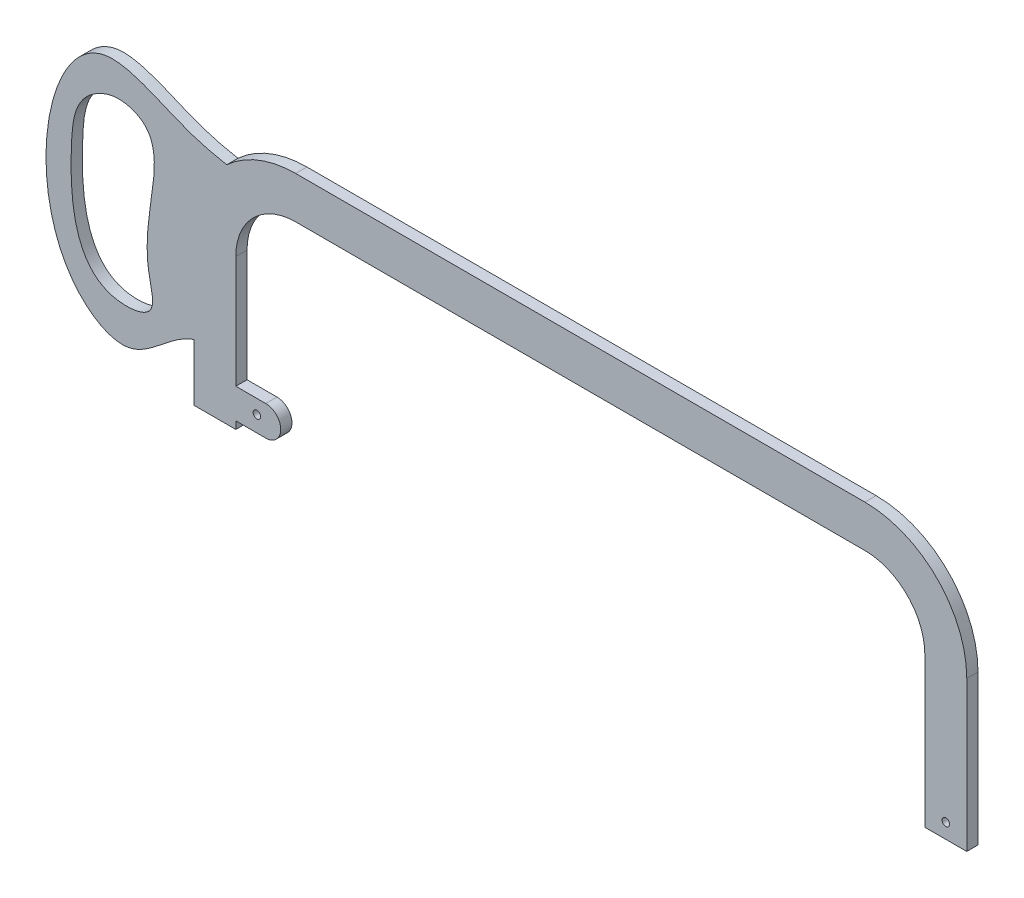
from build123d import *

# Parameters (mm, degrees)
EXTRUDE1_DEPTH     = 2.38125
EXTRUDE2_DEPTH     = 4.7625
SKETCH5_R          = 1.5875
CUT_EXTRUDE1_DEPTH = 222.476947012
EXTRUDE3_DEPTH     = 4.7625


with BuildPart() as part:
    # Sketch2 → Extrude1 (new, symmetric)
    with BuildSketch(Plane.XY):
        with BuildLine():
            Line((-176.25281746, 0), (-176.25281746, 63.5))
            ThreePointArc((-176.25281746, 63.5), (-168.813329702, 81.460512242), (-150.85281746, 88.9))
            Line((-150.85281746, 88.9), (90.44718254, 88.9))
            ThreePointArc((90.44718254, 88.9), (108.407694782, 81.460512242), (115.84718254, 63.5))
            Line((115.84718254, 63.5), (115.84718254, 0))
            Line((115.84718254, 0), (133.62718254, 0))
            Line((133.62718254, 0), (133.62718254, 63.5))
            ThreePointArc((133.62718254, 63.5), (120.980053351, 94.032870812), (90.44718254, 106.68))
            Line((90.44718254, 106.68), (-150.85281746, 106.68))
            ThreePointArc((-150.85281746, 106.68), (-181.385688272, 94.032870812), (-194.03281746, 63.5))
            Line((-194.03281746, 63.5), (-194.03281746, 0))
            Line((-194.03281746, 0), (-176.25281746, 0))
        make_face()
    extrude(amount=EXTRUDE1_DEPTH, both=True)

    # Sketch4 → Extrude2 (add)
    with BuildSketch(Plane.XY.offset(2.38125)):
        with BuildLine():
            Line((-176.25281746, 3.175), (-163.55281746, 3.175))
            ThreePointArc((-163.55281746, 3.175), (-157.20281746, 9.525), (-163.55281746, 15.875))
            Line((-163.55281746, 15.875), (-176.25281746, 15.875))
            Line((-176.25281746, 15.875), (-176.25281746, 3.175))
        make_face()
    extrude(amount=-EXTRUDE2_DEPTH)

    # Sketch5 → Cut-Extrude1 (cut, through all)
    with BuildSketch(Plane.XY.offset(2.38125)):
        with Locations((-167.33627827, 9.938552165)):
            Circle(SKETCH5_R)
        with Locations((124.73718254, 6.35)):
            Circle(SKETCH5_R)
    extrude(amount=-CUT_EXTRUDE1_DEPTH, mode=Mode.SUBTRACT)

    # Sketch6 → Extrude3 (add)
    with BuildSketch(Plane.XY.offset(2.38125)):
        with BuildLine():
            Line((-163.500086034, 92.976717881), (-185.371005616, 71.105798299))
            Line((-185.371005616, 71.105798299), (-185.371005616, 24.54132394))
            add(Edge.make_bspline(
                [(-163.500086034, 92.976717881), (-174.215818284, 94.230099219), (-196.776448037, 96.868936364), (-252.859222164, 130.124714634), (-269.426470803, 29.793267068), (-217.090656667, -1.29085574), (-200.757769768, 26.337811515), (-186.899721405, 24.719809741), (-185.371005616, 24.54132394)],
                knots=[0, 0, 0, 0, 0.145421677, 0.306167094, 0.711218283, 0.818840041, 0.980015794, 1, 1, 1, 1], degree=3))
        make_face()
        with BuildLine():
            add(Edge.make_bspline(
                [(-241.01195368, 88.809462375), (-244.988611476, 83.648741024), (-247.283551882, 60.105540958), (-244.91572239, 18.853735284), (-208.081682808, 23.123723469), (-220.297957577, 55.393154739), (-201.095560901, 90.740536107), (-229.023756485, 98.126858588), (-237.642234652, 93.182526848), (-241.01195368, 88.809462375)],
                knots=[0, 0, 0, 0, 0.110817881, 0.392381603, 0.473965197, 0.559095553, 0.859488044, 0.906095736, 1, 1, 1, 1], degree=3))
        make_face(mode=Mode.SUBTRACT)
    extrude(amount=-EXTRUDE3_DEPTH)


solid = part.part
